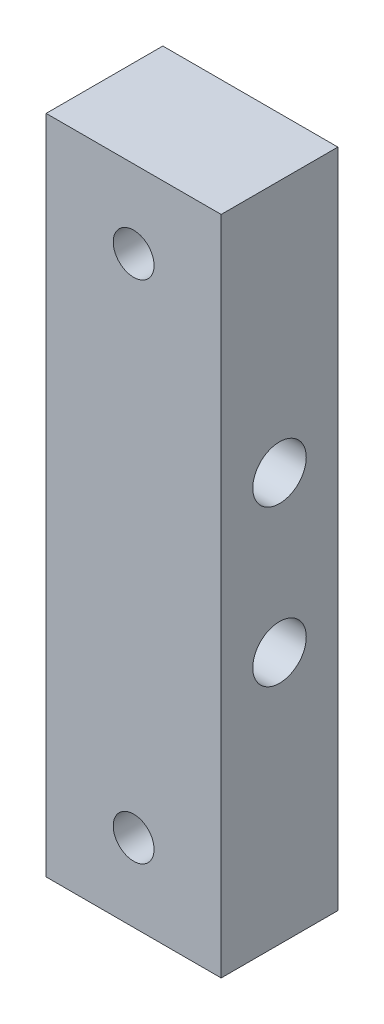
from build123d import *

# Parameters (mm, degrees)
ESQUISSE1_W       = 18
ESQUISSE1_H       = 68
EXTRUSION1_DEPTH  = 12
D_GAGEMENT_M51_D  = 5.5
TROU_TARAUD_M51_D = 4.2


with BuildPart() as part:
    # Esquisse1 → Extrusion1 (new body)
    with BuildSketch(Plane.XY):
        with Locations((9, 34)):
            Rectangle(ESQUISSE1_W, ESQUISSE1_H)
    extrude(amount=EXTRUSION1_DEPTH)

    # D_gagement M51 (through all)
    with Locations(Plane(origin=(18, 0, 0), x_dir=(0, 0, -1), z_dir=(1, 0, 0))):
        with Locations((-6, 42), (-6, 26)):
            Hole(D_GAGEMENT_M51_D / 2)

    # Trou taraud_ M51 (through all)
    with Locations(Plane(origin=(9, 60, 12), x_dir=(1, 0, 0), z_dir=(0, 0, 1))):
        with Locations((0, 0), (0, -52)):
            Hole(TROU_TARAUD_M51_D / 2)


solid = part.part
